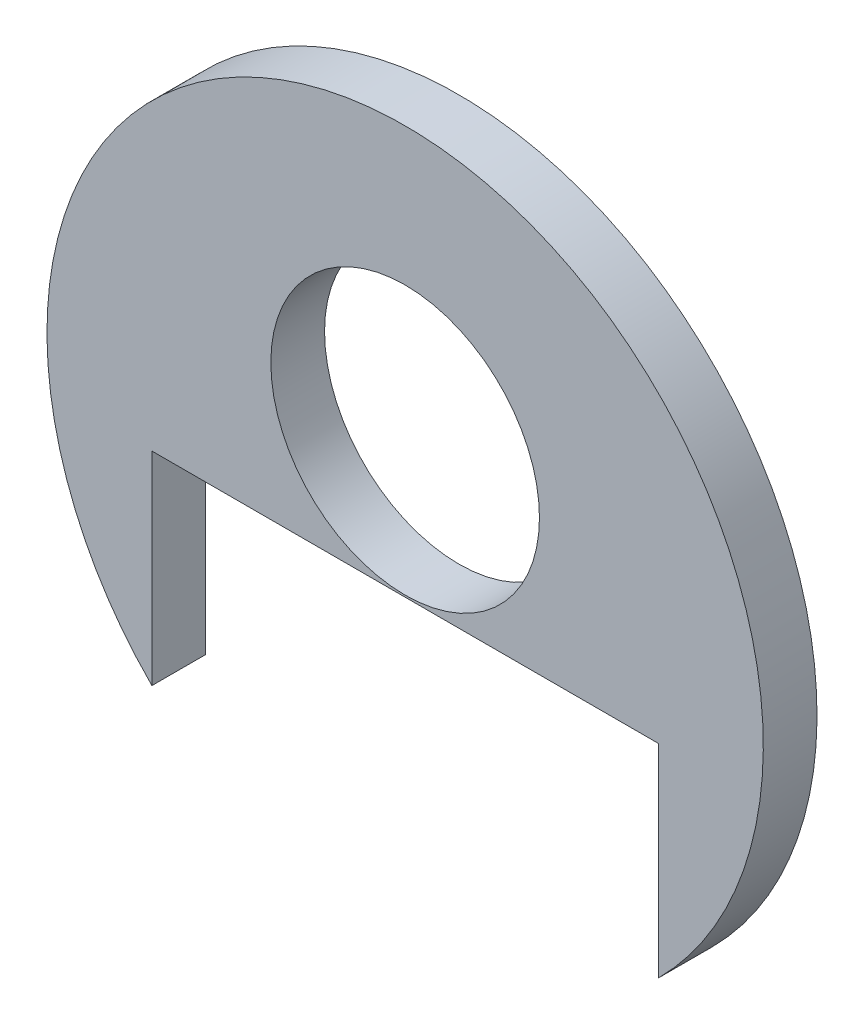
from build123d import *

# Parameters (mm, degrees)
SKETCH1_R           = 25.4
EXTRUDE1_DEPTH      = 3.81
SKETCH2_R           = 9.525
CUT_EXTRUDE1_DEPTH  = 37.122515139
SKETCH3_W           = 35.9156
SKETCH3_H           = 24.549169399
CUT_EXTRUDE10_DEPTH = 37.122515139


with BuildPart() as part:
    # Sketch1 → Extrude1 (new body)
    with BuildSketch(Plane.XY):
        Circle(SKETCH1_R)
    extrude(amount=-EXTRUDE1_DEPTH)

    # Sketch2 → Cut-Extrude1 (cut, through all)
    with BuildSketch(Plane.XY):
        with Locations((0, 6.096)):
            Circle(SKETCH2_R)
    extrude(amount=-CUT_EXTRUDE1_DEPTH, mode=Mode.SUBTRACT)

    # Sketch3 → Cut-Extrude10 (cut, through all)
    with BuildSketch(Plane.XY):
        with Locations((0, -15.8305847)):
            Rectangle(SKETCH3_W, SKETCH3_H)
    extrude(amount=-CUT_EXTRUDE10_DEPTH, mode=Mode.SUBTRACT)


solid = part.part
